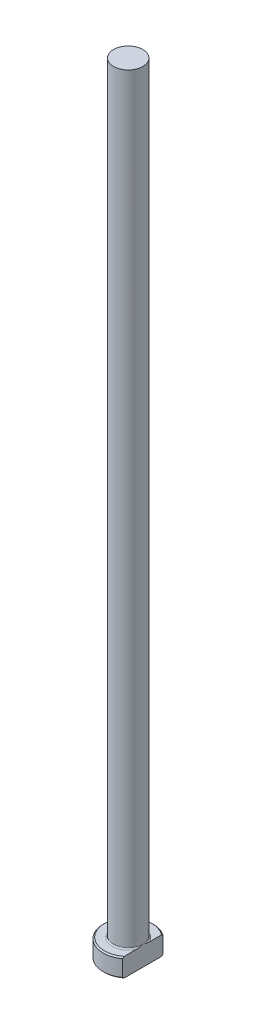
ISO-10303-21;
HEADER;
FILE_DESCRIPTION(('STEP AP214'),'2;1');
FILE_NAME('part.step','',(''),(''),'','','');
FILE_SCHEMA(('AUTOMOTIVE_DESIGN { 1 0 10303 214 1 1 1 1 }'));
ENDSEC;
DATA;
#1=APPLICATION_CONTEXT('core data for automotive mechanical design processes');
#2=APPLICATION_PROTOCOL_DEFINITION('international standard','automotive_design',2000,#1);
#3=PRODUCT_CONTEXT('',#1,'mechanical');
#4=PRODUCT('Part','Part','',(#3));
#5=PRODUCT_RELATED_PRODUCT_CATEGORY('part','',(#4));
#6=PRODUCT_DEFINITION_FORMATION('','',#4);
#7=PRODUCT_DEFINITION_CONTEXT('part definition',#1,'design');
#8=PRODUCT_DEFINITION('design','',#6,#7);
#9=PRODUCT_DEFINITION_SHAPE('','',#8);
#10=(LENGTH_UNIT() NAMED_UNIT(*) SI_UNIT(.MILLI.,.METRE.));
#11=(NAMED_UNIT(*) PLANE_ANGLE_UNIT() SI_UNIT($,.RADIAN.));
#12=(NAMED_UNIT(*) SI_UNIT($,.STERADIAN.) SOLID_ANGLE_UNIT());
#13=UNCERTAINTY_MEASURE_WITH_UNIT(LENGTH_MEASURE(1.E-05),#10,'distance_accuracy_value','');
#14=(GEOMETRIC_REPRESENTATION_CONTEXT(3) GLOBAL_UNCERTAINTY_ASSIGNED_CONTEXT((#13)) GLOBAL_UNIT_ASSIGNED_CONTEXT((#10,
#11,#12)) REPRESENTATION_CONTEXT('',''));
#15=CARTESIAN_POINT('',(0.,0.,0.));
#16=DIRECTION('',(0.,0.,1.));
#17=DIRECTION('',(1.,0.,0.));
#18=AXIS2_PLACEMENT_3D('',#15,#16,#17);
#19=CARTESIAN_POINT('',(0.,0.,0.));
#20=DIRECTION('',(0.,-1.,0.));
#21=DIRECTION('',(0.,0.,-1.));
#22=AXIS2_PLACEMENT_3D('',#19,#20,#21);
#23=PLANE('',#22);
#24=CARTESIAN_POINT('',(0.,0.,0.));
#25=DIRECTION('',(0.,-1.,0.));
#26=DIRECTION('',(0.,0.,-1.));
#27=AXIS2_PLACEMENT_3D('',#24,#25,#26);
#28=CIRCLE('',#27,3.79999999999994);
#29=CARTESIAN_POINT('',(2.34999999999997,0.,2.98621834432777));
#30=VERTEX_POINT('',#29);
#31=CARTESIAN_POINT('',(2.34999999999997,0.,-2.98621834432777));
#32=VERTEX_POINT('',#31);
#33=EDGE_CURVE('E98',#30,#32,#28,.T.);
#34=ORIENTED_EDGE('',*,*,#33,.T.);
#35=DIRECTION('',(0.,0.,1.));
#36=VECTOR('',#35,1.);
#37=CARTESIAN_POINT('',(2.34999999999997,0.,-3.23689666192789));
#38=LINE('',#37,#36);
#39=EDGE_CURVE('E83',#32,#30,#38,.T.);
#40=ORIENTED_EDGE('',*,*,#39,.T.);
#41=EDGE_LOOP('',(#34,#40));
#42=FACE_BOUND('',#41,.T.);
#43=ADVANCED_FACE('F32',(#42),#23,.T.);
#44=CARTESIAN_POINT('',(0.,259.958771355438,0.));
#45=DIRECTION('',(0.,1.,0.));
#46=DIRECTION('',(0.,0.,1.));
#47=AXIS2_PLACEMENT_3D('',#44,#45,#46);
#48=CYLINDRICAL_SURFACE('',#47,3.99999999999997);
#49=CARTESIAN_POINT('',(0.,2.79999999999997,0.));
#50=DIRECTION('',(0.,1.,0.));
#51=DIRECTION('',(0.,0.,1.));
#52=AXIS2_PLACEMENT_3D('',#49,#50,#51);
#53=CIRCLE('',#52,3.99999999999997);
#54=CARTESIAN_POINT('',(2.34999999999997,2.79999999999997,3.23689666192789));
#55=VERTEX_POINT('',#54);
#56=CARTESIAN_POINT('',(2.34999999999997,2.79999999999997,-3.23689666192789));
#57=VERTEX_POINT('',#56);
#58=EDGE_CURVE('E104',#55,#57,#53,.F.);
#59=ORIENTED_EDGE('',*,*,#58,.T.);
#60=DIRECTION('',(0.,-1.,0.));
#61=VECTOR('',#60,1.);
#62=CARTESIAN_POINT('',(2.34999999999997,125.,-3.23689666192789));
#63=LINE('',#62,#61);
#64=CARTESIAN_POINT('',(2.34999999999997,0.200000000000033,-3.23689666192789));
#65=VERTEX_POINT('',#64);
#66=EDGE_CURVE('E183',#57,#65,#63,.T.);
#67=ORIENTED_EDGE('',*,*,#66,.T.);
#68=CARTESIAN_POINT('',(0.,0.200000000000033,0.));
#69=DIRECTION('',(0.,-1.,0.));
#70=DIRECTION('',(0.,0.,-1.));
#71=AXIS2_PLACEMENT_3D('',#68,#69,#70);
#72=CIRCLE('',#71,3.99999999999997);
#73=CARTESIAN_POINT('',(2.34999999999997,0.200000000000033,3.23689666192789));
#74=VERTEX_POINT('',#73);
#75=EDGE_CURVE('E100',#65,#74,#72,.F.);
#76=ORIENTED_EDGE('',*,*,#75,.T.);
#77=DIRECTION('',(0.,-1.,0.));
#78=VECTOR('',#77,1.);
#79=CARTESIAN_POINT('',(2.34999999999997,125.,3.23689666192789));
#80=LINE('',#79,#78);
#81=EDGE_CURVE('E93',#55,#74,#80,.T.);
#82=ORIENTED_EDGE('',*,*,#81,.F.);
#83=EDGE_LOOP('',(#59,#67,#76,#82));
#84=FACE_BOUND('',#83,.T.);
#85=ADVANCED_FACE('F158',(#84),#48,.T.);
#86=CARTESIAN_POINT('',(-3.99999999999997,3.,0.));
#87=DIRECTION('',(0.,1.,0.));
#88=DIRECTION('',(0.,0.,1.));
#89=AXIS2_PLACEMENT_3D('',#86,#87,#88);
#90=PLANE('',#89);
#91=CARTESIAN_POINT('',(0.,3.,0.));
#92=DIRECTION('',(0.,1.,0.));
#93=DIRECTION('',(0.,0.,1.));
#94=AXIS2_PLACEMENT_3D('',#91,#92,#93);
#95=CIRCLE('',#94,3.79999999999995);
#96=CARTESIAN_POINT('',(2.34999999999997,3.,-2.98621834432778));
#97=VERTEX_POINT('',#96);
#98=CARTESIAN_POINT('',(2.34999999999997,3.,2.98621834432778));
#99=VERTEX_POINT('',#98);
#100=EDGE_CURVE('E178',#97,#99,#95,.T.);
#101=ORIENTED_EDGE('',*,*,#100,.T.);
#102=DIRECTION('',(0.,0.,-1.));
#103=VECTOR('',#102,1.);
#104=CARTESIAN_POINT('',(2.34999999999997,3.,0.));
#105=LINE('',#104,#103);
#106=CARTESIAN_POINT('',(2.34999999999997,2.99999999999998,0.989949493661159));
#107=VERTEX_POINT('',#106);
#108=EDGE_CURVE('E57',#99,#107,#105,.T.);
#109=ORIENTED_EDGE('',*,*,#108,.T.);
#110=CARTESIAN_POINT('',(0.,3.,0.));
#111=DIRECTION('',(0.,1.,0.));
#112=DIRECTION('',(0.,0.,1.));
#113=AXIS2_PLACEMENT_3D('',#110,#111,#112);
#114=CIRCLE('',#113,2.54999999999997);
#115=CARTESIAN_POINT('',(2.34999999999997,2.99999999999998,-0.989949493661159));
#116=VERTEX_POINT('',#115);
#117=EDGE_CURVE('E107',#107,#116,#114,.F.);
#118=ORIENTED_EDGE('',*,*,#117,.T.);
#119=EDGE_CURVE('E136',#116,#97,#105,.T.);
#120=ORIENTED_EDGE('',*,*,#119,.T.);
#121=EDGE_LOOP('',(#101,#109,#118,#120));
#122=FACE_BOUND('',#121,.T.);
#123=ADVANCED_FACE('F147',(#122),#90,.T.);
#124=CARTESIAN_POINT('',(0.,3.,0.));
#125=DIRECTION('',(0.,-1.,0.));
#126=DIRECTION('',(0.,0.,-1.));
#127=AXIS2_PLACEMENT_3D('',#124,#125,#126);
#128=CONICAL_SURFACE('',#127,3.79999999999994,0.785398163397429);
#129=ORIENTED_EDGE('',*,*,#58,.F.);
#130=CARTESIAN_POINT('',(2.34999999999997,-0.700856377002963,7.12322584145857));
#131=CARTESIAN_POINT('',(2.34999999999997,-0.585941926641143,7.00221702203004));
#132=CARTESIAN_POINT('',(2.34999999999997,-0.471176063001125,6.88106709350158));
#133=CARTESIAN_POINT('',(2.34999999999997,-0.241996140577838,6.63843358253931));
#134=CARTESIAN_POINT('',(2.34999999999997,-0.127582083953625,6.51694999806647));
#135=CARTESIAN_POINT('',(2.34999999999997,0.215169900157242,6.15179430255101));
#136=CARTESIAN_POINT('',(2.34999999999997,0.442895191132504,5.90754596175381));
#137=CARTESIAN_POINT('',(2.34999999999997,0.899497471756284,5.41318459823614));
#138=CARTESIAN_POINT('',(2.34999999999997,1.12833917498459,5.16303891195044));
#139=CARTESIAN_POINT('',(2.34999999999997,1.58241172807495,4.65967689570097));
#140=CARTESIAN_POINT('',(2.34999999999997,1.80764410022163,4.40646194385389));
#141=CARTESIAN_POINT('',(2.34999999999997,2.21600221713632,3.93721563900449));
#142=CARTESIAN_POINT('',(2.34999999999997,2.39996239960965,3.72191569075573));
#143=CARTESIAN_POINT('',(2.34999999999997,2.67143803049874,3.39502060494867));
#144=CARTESIAN_POINT('',(2.34999999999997,2.76124091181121,3.28532776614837));
#145=CARTESIAN_POINT('',(2.34999999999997,2.93886030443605,3.06434945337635));
#146=CARTESIAN_POINT('',(2.34999999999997,3.02667691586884,2.95306406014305));
#147=CARTESIAN_POINT('',(2.34999999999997,3.19949645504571,2.72877711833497));
#148=CARTESIAN_POINT('',(2.34999999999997,3.28450603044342,2.61578071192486));
#149=CARTESIAN_POINT('',(2.34999999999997,3.45108912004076,2.38722377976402));
#150=CARTESIAN_POINT('',(2.34999999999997,3.53266178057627,2.27166262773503));
#151=CARTESIAN_POINT('',(2.34999999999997,3.69088588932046,2.03753037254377));
#152=CARTESIAN_POINT('',(2.34999999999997,3.76754679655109,1.91896570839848));
#153=CARTESIAN_POINT('',(2.34999999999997,3.914131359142,1.67777357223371));
#154=CARTESIAN_POINT('',(2.34999999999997,3.98405924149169,1.55514871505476));
#155=CARTESIAN_POINT('',(2.34999999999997,4.09761312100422,1.33668409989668));
#156=CARTESIAN_POINT('',(2.34999999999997,4.14340149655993,1.24197842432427));
#157=CARTESIAN_POINT('',(2.34999999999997,4.22781425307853,1.04934973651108));
#158=CARTESIAN_POINT('',(2.34999999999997,4.26643728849,0.951426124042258));
#159=CARTESIAN_POINT('',(2.34999999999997,4.33394568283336,0.753323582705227));
#160=CARTESIAN_POINT('',(2.34999999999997,4.36292600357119,0.653177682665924));
#161=CARTESIAN_POINT('',(2.34999999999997,4.40928787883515,0.450234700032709));
#162=CARTESIAN_POINT('',(2.34999999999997,4.42667991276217,0.347440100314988));
#163=CARTESIAN_POINT('',(2.34999999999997,4.44509392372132,0.169206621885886));
#164=CARTESIAN_POINT('',(2.34999999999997,4.44931933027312,0.0940925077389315));
#165=CARTESIAN_POINT('',(2.34999999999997,4.45052785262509,-0.0561912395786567));
#166=CARTESIAN_POINT('',(2.34999999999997,4.4475119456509,-0.131360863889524));
#167=CARTESIAN_POINT('',(2.34999999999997,4.43440638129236,-0.281306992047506));
#168=CARTESIAN_POINT('',(2.34999999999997,4.42429455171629,-0.35608152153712));
#169=CARTESIAN_POINT('',(2.34999999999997,4.39757556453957,-0.504456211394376));
#170=CARTESIAN_POINT('',(2.34999999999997,4.3809668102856,-0.578056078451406));
#171=CARTESIAN_POINT('',(2.34999999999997,4.33328847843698,-0.756675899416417));
#172=CARTESIAN_POINT('',(2.34999999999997,4.29907594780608,-0.860854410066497));
#173=CARTESIAN_POINT('',(2.34999999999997,4.22140056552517,-1.06568624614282));
#174=CARTESIAN_POINT('',(2.34999999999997,4.17793098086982,-1.16633694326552));
#175=CARTESIAN_POINT('',(2.34999999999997,4.08383876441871,-1.36480952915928));
#176=CARTESIAN_POINT('',(2.34999999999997,4.03318169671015,-1.46261489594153));
#177=CARTESIAN_POINT('',(2.34999999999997,3.95330034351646,-1.60710986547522));
#178=CARTESIAN_POINT('',(2.34999999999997,3.92602819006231,-1.65489920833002));
#179=CARTESIAN_POINT('',(2.34999999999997,3.87034838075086,-1.74981001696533));
#180=CARTESIAN_POINT('',(2.34999999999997,3.84194077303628,-1.7969315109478));
#181=CARTESIAN_POINT('',(2.34999999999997,3.74736854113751,-1.95015020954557));
#182=CARTESIAN_POINT('',(2.34999999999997,3.67916021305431,-2.05498710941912));
#183=CARTESIAN_POINT('',(2.34999999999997,3.53901640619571,-2.26214963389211));
#184=CARTESIAN_POINT('',(2.34999999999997,3.4670800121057,-2.3644746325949));
#185=CARTESIAN_POINT('',(2.34999999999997,3.3203498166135,-2.56716934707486));
#186=CARTESIAN_POINT('',(2.34999999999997,3.24555383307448,-2.66753747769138));
#187=CARTESIAN_POINT('',(2.34999999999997,3.09379905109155,-2.86662881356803));
#188=CARTESIAN_POINT('',(2.34999999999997,3.01684010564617,-2.96535190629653));
#189=CARTESIAN_POINT('',(2.34999999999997,2.7830427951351,-3.26004190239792));
#190=CARTESIAN_POINT('',(2.34999999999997,2.6236754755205,-3.45399979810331));
#191=CARTESIAN_POINT('',(2.34999999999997,2.3007252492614,-3.83818937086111));
#192=CARTESIAN_POINT('',(2.34999999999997,2.13714428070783,-4.0284226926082));
#193=CARTESIAN_POINT('',(2.34999999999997,1.80677758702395,-4.40661405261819));
#194=CARTESIAN_POINT('',(2.34999999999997,1.63998718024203,-4.5945679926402));
#195=CARTESIAN_POINT('',(2.34999999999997,1.30429273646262,-4.968609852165));
#196=CARTESIAN_POINT('',(2.34999999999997,1.1353884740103,-5.15469756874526));
#197=CARTESIAN_POINT('',(2.34999999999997,0.79625864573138,-5.52521155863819));
#198=CARTESIAN_POINT('',(2.34999999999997,0.626035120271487,-5.70963970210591));
#199=CARTESIAN_POINT('',(2.34999999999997,0.284419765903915,-6.07741061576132));
#200=CARTESIAN_POINT('',(2.34999999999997,0.113027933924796,-6.26075338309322));
#201=CARTESIAN_POINT('',(2.34999999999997,-0.112202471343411,-6.50049374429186));
#202=CARTESIAN_POINT('',(2.34999999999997,-0.165631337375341,-6.5572768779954));
#203=CARTESIAN_POINT('',(2.34999999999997,-0.272578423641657,-6.67077412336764));
#204=CARTESIAN_POINT('',(2.34999999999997,-0.326096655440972,-6.72748822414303));
#205=CARTESIAN_POINT('',(2.34999999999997,-0.433118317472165,-6.84074875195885));
#206=CARTESIAN_POINT('',(2.34999999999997,-0.486621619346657,-6.89729530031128));
#207=CARTESIAN_POINT('',(2.34999999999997,-0.593691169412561,-7.0103135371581));
#208=CARTESIAN_POINT('',(2.34999999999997,-0.647257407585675,-7.0667852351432));
#209=CARTESIAN_POINT('',(2.34999999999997,-0.700856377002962,-7.12322584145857));
#210=B_SPLINE_CURVE_WITH_KNOTS('',3,(#130,#131,#132,#133,#134,#135,#136,#137,#138,#139,#140,
#141,#142,#143,#144,#145,#146,#147,#148,#149,#150,#151,#152,#153,#154,#155,#156,#157,#158,#159,
#160,#161,#162,#163,#164,#165,#166,#167,#168,#169,#170,#171,#172,#173,#174,#175,#176,#177,#178,
#179,#180,#181,#182,#183,#184,#185,#186,#187,#188,#189,#190,#191,#192,#193,#194,#195,#196,#197,
#198,#199,#200,#201,#202,#203,#204,#205,#206,#207,#208,#209),.UNSPECIFIED.,.F.,.F.,(4,2,2,2,2,2,
2,2,2,2,2,2,2,2,2,2,2,2,2,2,2,2,2,2,2,2,2,2,2,2,2,2,2,2,2,2,2,2,2,4),(0.,0.500635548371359,
1.00127416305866,2.00308434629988,3.02015300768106,4.03678077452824,4.88626044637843,
5.31153593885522,5.73678994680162,6.16095168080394,6.58521815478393,7.00864136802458,
7.43179699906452,7.74715928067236,8.06258072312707,8.37479699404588,8.68673054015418,
8.91210094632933,9.13744094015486,9.3634881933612,9.58959103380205,9.91793468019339,
10.246517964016,10.576732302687,10.7417913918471,10.9068434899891,11.2819382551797,
11.6571255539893,12.0326051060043,12.4081102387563,13.1610954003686,13.9137401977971,
14.6675815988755,15.4215040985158,16.1744305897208,16.9273590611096,17.1612622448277,
17.3951984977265,17.6287386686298,17.8622456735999),.UNSPECIFIED.);
#211=EDGE_CURVE('E135',#55,#99,#210,.T.);
#212=ORIENTED_EDGE('',*,*,#211,.T.);
#213=ORIENTED_EDGE('',*,*,#100,.F.);
#214=EDGE_CURVE('E127',#97,#57,#210,.T.);
#215=ORIENTED_EDGE('',*,*,#214,.T.);
#216=EDGE_LOOP('',(#129,#212,#213,#215));
#217=FACE_BOUND('',#216,.T.);
#218=ADVANCED_FACE('F143',(#217),#128,.T.);
#219=CARTESIAN_POINT('',(0.,0.200000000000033,0.));
#220=DIRECTION('',(0.,1.,0.));
#221=DIRECTION('',(0.,0.,1.));
#222=AXIS2_PLACEMENT_3D('',#219,#220,#221);
#223=CONICAL_SURFACE('',#222,3.99999999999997,0.785398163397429);
#224=ORIENTED_EDGE('',*,*,#75,.F.);
#225=CARTESIAN_POINT('',(2.34999999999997,3.70085637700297,-7.12322584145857));
#226=CARTESIAN_POINT('',(2.34999999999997,3.58594192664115,-7.00221702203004));
#227=CARTESIAN_POINT('',(2.34999999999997,3.47117606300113,-6.88106709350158));
#228=CARTESIAN_POINT('',(2.34999999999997,3.24199614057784,-6.63843358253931));
#229=CARTESIAN_POINT('',(2.34999999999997,3.12758208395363,-6.51694999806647));
#230=CARTESIAN_POINT('',(2.34999999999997,2.78483009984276,-6.15179430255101));
#231=CARTESIAN_POINT('',(2.34999999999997,2.5571048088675,-5.9075459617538));
#232=CARTESIAN_POINT('',(2.34999999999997,2.10050252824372,-5.41318459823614));
#233=CARTESIAN_POINT('',(2.34999999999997,1.87166082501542,-5.16303891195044));
#234=CARTESIAN_POINT('',(2.34999999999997,1.41758827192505,-4.65967689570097));
#235=CARTESIAN_POINT('',(2.34999999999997,1.19235589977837,-4.40646194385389));
#236=CARTESIAN_POINT('',(2.34999999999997,0.783997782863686,-3.93721563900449));
#237=CARTESIAN_POINT('',(2.34999999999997,0.600037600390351,-3.72191569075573));
#238=CARTESIAN_POINT('',(2.34999999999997,0.328561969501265,-3.39502060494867));
#239=CARTESIAN_POINT('',(2.34999999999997,0.238759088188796,-3.28532776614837));
#240=CARTESIAN_POINT('',(2.34999999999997,0.0611396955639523,-3.06434945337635));
#241=CARTESIAN_POINT('',(2.34999999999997,-0.0266769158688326,-2.95306406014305));
#242=CARTESIAN_POINT('',(2.34999999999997,-0.199496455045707,-2.72877711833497));
#243=CARTESIAN_POINT('',(2.34999999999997,-0.28450603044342,-2.61578071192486));
#244=CARTESIAN_POINT('',(2.34999999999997,-0.451089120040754,-2.38722377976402));
#245=CARTESIAN_POINT('',(2.34999999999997,-0.532661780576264,-2.27166262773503));
#246=CARTESIAN_POINT('',(2.34999999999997,-0.690885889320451,-2.03753037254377));
#247=CARTESIAN_POINT('',(2.34999999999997,-0.767546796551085,-1.91896570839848));
#248=CARTESIAN_POINT('',(2.34999999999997,-0.914131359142,-1.67777357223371));
#249=CARTESIAN_POINT('',(2.34999999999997,-0.984059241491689,-1.55514871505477));
#250=CARTESIAN_POINT('',(2.34999999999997,-1.09761312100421,-1.33668409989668));
#251=CARTESIAN_POINT('',(2.34999999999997,-1.14340149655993,-1.24197842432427));
#252=CARTESIAN_POINT('',(2.34999999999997,-1.22781425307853,-1.04934973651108));
#253=CARTESIAN_POINT('',(2.34999999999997,-1.26643728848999,-0.951426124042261));
#254=CARTESIAN_POINT('',(2.34999999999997,-1.33394568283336,-0.75332358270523));
#255=CARTESIAN_POINT('',(2.34999999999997,-1.36292600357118,-0.653177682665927));
#256=CARTESIAN_POINT('',(2.34999999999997,-1.40928787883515,-0.450234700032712));
#257=CARTESIAN_POINT('',(2.34999999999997,-1.42667991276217,-0.347440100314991));
#258=CARTESIAN_POINT('',(2.34999999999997,-1.44509392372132,-0.169206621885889));
#259=CARTESIAN_POINT('',(2.34999999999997,-1.44931933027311,-0.0940925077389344));
#260=CARTESIAN_POINT('',(2.34999999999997,-1.45052785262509,0.0561912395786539));
#261=CARTESIAN_POINT('',(2.34999999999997,-1.4475119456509,0.131360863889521));
#262=CARTESIAN_POINT('',(2.34999999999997,-1.43440638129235,0.281306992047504));
#263=CARTESIAN_POINT('',(2.34999999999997,-1.42429455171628,0.356081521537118));
#264=CARTESIAN_POINT('',(2.34999999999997,-1.39757556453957,0.504456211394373));
#265=CARTESIAN_POINT('',(2.34999999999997,-1.38096681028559,0.578056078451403));
#266=CARTESIAN_POINT('',(2.34999999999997,-1.33328847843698,0.756675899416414));
#267=CARTESIAN_POINT('',(2.34999999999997,-1.29907594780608,0.860854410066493));
#268=CARTESIAN_POINT('',(2.34999999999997,-1.22140056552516,1.06568624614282));
#269=CARTESIAN_POINT('',(2.34999999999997,-1.17793098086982,1.16633694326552));
#270=CARTESIAN_POINT('',(2.34999999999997,-1.08383876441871,1.36480952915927));
#271=CARTESIAN_POINT('',(2.34999999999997,-1.03318169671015,1.46261489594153));
#272=CARTESIAN_POINT('',(2.34999999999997,-0.953300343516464,1.60710986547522));
#273=CARTESIAN_POINT('',(2.34999999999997,-0.926028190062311,1.65489920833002));
#274=CARTESIAN_POINT('',(2.34999999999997,-0.870348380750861,1.74981001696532));
#275=CARTESIAN_POINT('',(2.34999999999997,-0.841940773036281,1.79693151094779));
#276=CARTESIAN_POINT('',(2.34999999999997,-0.747368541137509,1.95015020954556));
#277=CARTESIAN_POINT('',(2.34999999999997,-0.679160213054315,2.05498710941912));
#278=CARTESIAN_POINT('',(2.34999999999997,-0.539016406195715,2.2621496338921));
#279=CARTESIAN_POINT('',(2.34999999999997,-0.467080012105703,2.36447463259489));
#280=CARTESIAN_POINT('',(2.34999999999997,-0.3203498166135,2.56716934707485));
#281=CARTESIAN_POINT('',(2.34999999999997,-0.245553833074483,2.66753747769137));
#282=CARTESIAN_POINT('',(2.34999999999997,-0.0937990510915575,2.86662881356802));
#283=CARTESIAN_POINT('',(2.34999999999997,-0.0168401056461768,2.96535190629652));
#284=CARTESIAN_POINT('',(2.34999999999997,0.216957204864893,3.26004190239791));
#285=CARTESIAN_POINT('',(2.34999999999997,0.376324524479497,3.4539997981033));
#286=CARTESIAN_POINT('',(2.34999999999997,0.699274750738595,3.83818937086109));
#287=CARTESIAN_POINT('',(2.34999999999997,0.862855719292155,4.02842269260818));
#288=CARTESIAN_POINT('',(2.34999999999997,1.19322241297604,4.40661405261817));
#289=CARTESIAN_POINT('',(2.34999999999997,1.36001281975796,4.59456799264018));
#290=CARTESIAN_POINT('',(2.34999999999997,1.69570726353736,4.96860985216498));
#291=CARTESIAN_POINT('',(2.34999999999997,1.86461152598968,5.15469756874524));
#292=CARTESIAN_POINT('',(2.34999999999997,2.2037413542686,5.52521155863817));
#293=CARTESIAN_POINT('',(2.34999999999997,2.37396487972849,5.70963970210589));
#294=CARTESIAN_POINT('',(2.34999999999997,2.71558023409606,6.07741061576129));
#295=CARTESIAN_POINT('',(2.34999999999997,2.88697206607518,6.26075338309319));
#296=CARTESIAN_POINT('',(2.34999999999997,3.11220247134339,6.50049374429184));
#297=CARTESIAN_POINT('',(2.34999999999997,3.16563133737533,6.55727687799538));
#298=CARTESIAN_POINT('',(2.34999999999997,3.27257842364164,6.67077412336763));
#299=CARTESIAN_POINT('',(2.34999999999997,3.32609665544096,6.72748822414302));
#300=CARTESIAN_POINT('',(2.34999999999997,3.43311831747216,6.84074875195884));
#301=CARTESIAN_POINT('',(2.34999999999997,3.48662161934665,6.89729530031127));
#302=CARTESIAN_POINT('',(2.34999999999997,3.59369116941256,7.0103135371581));
#303=CARTESIAN_POINT('',(2.34999999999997,3.64725740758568,7.0667852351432));
#304=CARTESIAN_POINT('',(2.34999999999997,3.70085637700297,7.12322584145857));
#305=B_SPLINE_CURVE_WITH_KNOTS('',3,(#225,#226,#227,#228,#229,#230,#231,#232,#233,#234,#235,
#236,#237,#238,#239,#240,#241,#242,#243,#244,#245,#246,#247,#248,#249,#250,#251,#252,#253,#254,
#255,#256,#257,#258,#259,#260,#261,#262,#263,#264,#265,#266,#267,#268,#269,#270,#271,#272,#273,
#274,#275,#276,#277,#278,#279,#280,#281,#282,#283,#284,#285,#286,#287,#288,#289,#290,#291,#292,
#293,#294,#295,#296,#297,#298,#299,#300,#301,#302,#303,#304),.UNSPECIFIED.,.F.,.F.,(4,2,2,2,2,2,
2,2,2,2,2,2,2,2,2,2,2,2,2,2,2,2,2,2,2,2,2,2,2,2,2,2,2,2,2,2,2,2,2,4),(0.,0.50063554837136,
1.00127416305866,2.00308434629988,3.02015300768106,4.03678077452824,4.88626044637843,
5.31153593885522,5.73678994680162,6.16095168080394,6.58521815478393,7.00864136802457,
7.43179699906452,7.74715928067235,8.06258072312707,8.37479699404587,8.68673054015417,
8.91210094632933,9.13744094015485,9.3634881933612,9.58959103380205,9.91793468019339,
10.246517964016,10.576732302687,10.7417913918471,10.9068434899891,11.2819382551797,
11.6571255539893,12.0326051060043,12.4081102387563,13.1610954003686,13.913740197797,
14.6675815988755,15.4215040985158,16.1744305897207,16.9273590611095,17.1612622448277,
17.3951984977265,17.6287386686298,17.8622456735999),.UNSPECIFIED.);
#306=EDGE_CURVE('E86',#65,#32,#305,.T.);
#307=ORIENTED_EDGE('',*,*,#306,.T.);
#308=ORIENTED_EDGE('',*,*,#33,.F.);
#309=EDGE_CURVE('E89',#30,#74,#305,.T.);
#310=ORIENTED_EDGE('',*,*,#309,.T.);
#311=EDGE_LOOP('',(#224,#307,#308,#310));
#312=FACE_BOUND('',#311,.T.);
#313=ADVANCED_FACE('F97',(#312),#223,.T.);
#314=CARTESIAN_POINT('',(0.,3.19999999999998,0.));
#315=DIRECTION('',(0.,1.,0.));
#316=DIRECTION('',(0.,0.,1.));
#317=AXIS2_PLACEMENT_3D('',#314,#315,#316);
#318=TOROIDAL_SURFACE('',#317,2.54999999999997,0.2);
#319=CARTESIAN_POINT('',(2.34999999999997,3.19999999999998,0.));
#320=CARTESIAN_POINT('',(2.34999999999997,3.20000050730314,3.97301146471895E-11));
#321=CARTESIAN_POINT('',(2.34999999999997,3.20000101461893,-1.63653131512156E-07));
#322=CARTESIAN_POINT('',(2.34999999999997,3.20000197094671,-6.37225615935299E-07));
#323=CARTESIAN_POINT('',(2.34999999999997,3.20000241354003,-9.56393878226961E-07));
#324=CARTESIAN_POINT('',(2.34999999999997,3.20000331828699,-1.71856519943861E-06));
#325=CARTESIAN_POINT('',(2.34999999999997,3.20000377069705,-2.17342707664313E-06));
#326=CARTESIAN_POINT('',(2.34999999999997,3.20000459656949,-3.12835726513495E-06));
#327=CARTESIAN_POINT('',(2.34999999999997,3.20000497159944,-3.62715530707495E-06));
#328=CARTESIAN_POINT('',(2.34999999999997,3.20000632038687,-5.51226929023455E-06));
#329=CARTESIAN_POINT('',(2.34999999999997,3.20000721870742,-6.95455039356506E-06));
#330=CARTESIAN_POINT('',(2.34999999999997,3.20000873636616,-9.84867466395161E-06));
#331=CARTESIAN_POINT('',(2.34999999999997,3.20000937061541,-1.1293074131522E-05));
#332=CARTESIAN_POINT('',(2.34999999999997,3.20001195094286,-1.72675053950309E-05));
#333=CARTESIAN_POINT('',(2.34999999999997,3.20001382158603,-2.18342580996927E-05));
#334=CARTESIAN_POINT('',(2.34999999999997,3.2000166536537,-3.05622351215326E-05));
#335=CARTESIAN_POINT('',(2.34999999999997,3.2000177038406,-3.46947501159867E-05));
#336=CARTESIAN_POINT('',(2.34999999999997,3.20002522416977,-6.49852707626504E-05));
#337=CARTESIAN_POINT('',(2.34999999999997,3.20003079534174,-9.13194244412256E-05));
#338=CARTESIAN_POINT('',(2.34999999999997,3.2000551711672,-0.000194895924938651));
#339=CARTESIAN_POINT('',(2.34999999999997,3.20007855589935,-0.000271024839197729));
#340=CARTESIAN_POINT('',(2.34999999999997,3.20016914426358,-0.000571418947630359));
#341=CARTESIAN_POINT('',(2.34999999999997,3.20023327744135,-0.000796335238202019));
#342=CARTESIAN_POINT('',(2.34999999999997,3.20048915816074,-0.00168650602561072));
#343=CARTESIAN_POINT('',(2.34999999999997,3.20068469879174,-0.00235093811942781));
#344=CARTESIAN_POINT('',(2.34999999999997,3.20149494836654,-0.00511204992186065));
#345=CARTESIAN_POINT('',(2.34999999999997,3.20210492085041,-0.00720975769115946));
#346=CARTESIAN_POINT('',(2.34999999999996,3.2078795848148,-0.0270590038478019));
#347=CARTESIAN_POINT('',(2.34999999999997,3.21306460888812,-0.0448062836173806));
#348=CARTESIAN_POINT('',(2.34999999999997,3.22319239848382,-0.0796159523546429));
#349=CARTESIAN_POINT('',(2.34999999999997,3.22813669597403,-0.0966779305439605));
#350=CARTESIAN_POINT('',(2.34999999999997,3.23859474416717,-0.132940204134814));
#351=CARTESIAN_POINT('',(2.34999999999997,3.24410273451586,-0.152142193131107));
#352=CARTESIAN_POINT('',(2.34999999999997,3.25508732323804,-0.190778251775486));
#353=CARTESIAN_POINT('',(2.34999999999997,3.26056294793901,-0.210212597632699));
#354=CARTESIAN_POINT('',(2.34999999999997,3.27370944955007,-0.257444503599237));
#355=CARTESIAN_POINT('',(2.34999999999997,3.28131640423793,-0.285259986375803));
#356=CARTESIAN_POINT('',(2.34999999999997,3.29598901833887,-0.340268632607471));
#357=CARTESIAN_POINT('',(2.34999999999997,3.30306356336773,-0.367459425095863));
#358=CARTESIAN_POINT('',(2.34999999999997,3.32130563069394,-0.439911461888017));
#359=CARTESIAN_POINT('',(2.34999999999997,3.33209700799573,-0.485269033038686));
#360=CARTESIAN_POINT('',(2.34999999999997,3.35207859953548,-0.576761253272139));
#361=CARTESIAN_POINT('',(2.34999999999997,3.36125388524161,-0.622899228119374));
#362=CARTESIAN_POINT('',(2.34999999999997,3.37792670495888,-0.719572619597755));
#363=CARTESIAN_POINT('',(2.34999999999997,3.3852125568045,-0.770145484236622));
#364=CARTESIAN_POINT('',(2.34999999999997,3.39588167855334,-0.87157933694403));
#365=CARTESIAN_POINT('',(2.34999999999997,3.39927813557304,-0.92243876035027));
#366=CARTESIAN_POINT('',(2.34999999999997,3.4002008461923,-0.998268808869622));
#367=CARTESIAN_POINT('',(2.34999999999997,3.39983763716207,-1.02321254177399));
#368=CARTESIAN_POINT('',(2.34999999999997,3.39747624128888,-1.07301750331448));
#369=CARTESIAN_POINT('',(2.34999999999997,3.3954790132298,-1.09787877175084));
#370=CARTESIAN_POINT('',(2.34999999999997,3.38951136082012,-1.14688451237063));
#371=CARTESIAN_POINT('',(2.34999999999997,3.38557982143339,-1.17103355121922));
#372=CARTESIAN_POINT('',(2.34999999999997,3.37522613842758,-1.21877292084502));
#373=CARTESIAN_POINT('',(2.34999999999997,3.36880975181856,-1.24236441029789));
#374=CARTESIAN_POINT('',(2.34999999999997,3.3551050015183,-1.28139211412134));
#375=CARTESIAN_POINT('',(2.34999999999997,3.34867539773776,-1.29712639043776));
#376=CARTESIAN_POINT('',(2.34999999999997,3.33376103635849,-1.32763329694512));
#377=CARTESIAN_POINT('',(2.34999999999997,3.32527759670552,-1.34240653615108));
#378=CARTESIAN_POINT('',(2.34999999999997,3.30996401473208,-1.36406737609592));
#379=CARTESIAN_POINT('',(2.34999999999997,3.30402750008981,-1.37158321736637));
#380=CARTESIAN_POINT('',(2.34999999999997,3.29119867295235,-1.38575961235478));
#381=CARTESIAN_POINT('',(2.34999999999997,3.28430748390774,-1.39242115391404));
#382=CARTESIAN_POINT('',(2.34999999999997,3.27111764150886,-1.40316348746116));
#383=CARTESIAN_POINT('',(2.34999999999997,3.26502095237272,-1.40748979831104));
#384=CARTESIAN_POINT('',(2.34999999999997,3.25221216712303,-1.41511389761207));
#385=CARTESIAN_POINT('',(2.34999999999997,3.24550106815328,-1.41841331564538));
#386=CARTESIAN_POINT('',(2.34999999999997,3.23285600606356,-1.42321218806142));
#387=CARTESIAN_POINT('',(2.34999999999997,3.22700595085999,-1.42493102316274));
#388=CARTESIAN_POINT('',(2.34999999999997,3.21509932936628,-1.42735933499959));
#389=CARTESIAN_POINT('',(2.34999999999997,3.20904291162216,-1.42806952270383));
#390=CARTESIAN_POINT('',(2.34999999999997,3.19688696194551,-1.42841721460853));
#391=CARTESIAN_POINT('',(2.34999999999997,3.19078736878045,-1.42805261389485));
#392=CARTESIAN_POINT('',(2.34999999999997,3.17874187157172,-1.42628029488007));
#393=CARTESIAN_POINT('',(2.34999999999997,3.17279604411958,-1.42487206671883));
#394=CARTESIAN_POINT('',(2.34999999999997,3.16130302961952,-1.42116093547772));
#395=CARTESIAN_POINT('',(2.34999999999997,3.15575093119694,-1.41887295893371));
#396=CARTESIAN_POINT('',(2.34999999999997,3.1450217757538,-1.41355066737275));
#397=CARTESIAN_POINT('',(2.34999999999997,3.13984483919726,-1.41051611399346));
#398=CARTESIAN_POINT('',(2.34999999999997,3.12662898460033,-1.40165617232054));
#399=CARTESIAN_POINT('',(2.34999999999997,3.11894184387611,-1.39530630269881));
#400=CARTESIAN_POINT('',(2.34999999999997,3.10463862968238,-1.38149172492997));
#401=CARTESIAN_POINT('',(2.34999999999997,3.098026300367,-1.3740232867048));
#402=CARTESIAN_POINT('',(2.34999999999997,3.08144643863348,-1.35283380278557));
#403=CARTESIAN_POINT('',(2.34999999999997,3.07238753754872,-1.33840776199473));
#404=CARTESIAN_POINT('',(2.34999999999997,3.05644883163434,-1.30845169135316));
#405=CARTESIAN_POINT('',(2.34999999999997,3.04957029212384,-1.29292102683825));
#406=CARTESIAN_POINT('',(2.34999999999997,3.03757508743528,-1.26136930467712));
#407=CARTESIAN_POINT('',(2.34999999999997,3.03244275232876,-1.24535409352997));
#408=CARTESIAN_POINT('',(2.34999999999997,3.02353297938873,-1.21294404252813));
#409=CARTESIAN_POINT('',(2.34999999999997,3.01975697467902,-1.19654882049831));
#410=CARTESIAN_POINT('',(2.34999999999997,3.01003121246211,-1.14664956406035));
#411=CARTESIAN_POINT('',(2.34999999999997,3.00581272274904,-1.11281111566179));
#412=CARTESIAN_POINT('',(2.34999999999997,2.9993669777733,-1.02798337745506));
#413=CARTESIAN_POINT('',(2.34999999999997,2.99918477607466,-0.976864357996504));
#414=CARTESIAN_POINT('',(2.34999999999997,3.00375848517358,-0.874705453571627));
#415=CARTESIAN_POINT('',(2.34999999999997,3.00853512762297,-0.823666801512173));
#416=CARTESIAN_POINT('',(2.34999999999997,3.02118536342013,-0.725382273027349));
#417=CARTESIAN_POINT('',(2.34999999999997,3.02883644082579,-0.678106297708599));
#418=CARTESIAN_POINT('',(2.34999999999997,3.04631118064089,-0.584387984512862));
#419=CARTESIAN_POINT('',(2.34999999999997,3.05611566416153,-0.537941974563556));
#420=CARTESIAN_POINT('',(2.34999999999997,3.07458329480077,-0.457342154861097));
#421=CARTESIAN_POINT('',(2.34999999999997,3.08288953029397,-0.423104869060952));
#422=CARTESIAN_POINT('',(2.34999999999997,3.100392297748,-0.353909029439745));
#423=CARTESIAN_POINT('',(2.34999999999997,3.10960639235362,-0.318954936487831));
#424=CARTESIAN_POINT('',(2.34999999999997,3.12565453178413,-0.259778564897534));
#425=CARTESIAN_POINT('',(2.34999999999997,3.13236140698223,-0.235521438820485));
#426=CARTESIAN_POINT('',(2.34999999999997,3.14587896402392,-0.187317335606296));
#427=CARTESIAN_POINT('',(2.34999999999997,3.15268775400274,-0.16336982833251));
#428=CARTESIAN_POINT('',(2.34999999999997,3.16564916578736,-0.118168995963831));
#429=CARTESIAN_POINT('',(2.34999999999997,3.17179049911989,-0.0969123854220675));
#430=CARTESIAN_POINT('',(2.34999999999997,3.18438963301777,-0.0535409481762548));
#431=CARTESIAN_POINT('',(2.34999999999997,3.19085004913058,-0.0314268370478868));
#432=CARTESIAN_POINT('',(2.34999999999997,3.19789544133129,-0.00720839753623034));
#433=CARTESIAN_POINT('',(2.34999999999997,3.1985058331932,-0.00510934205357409));
#434=CARTESIAN_POINT('',(2.34999999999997,3.19931618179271,-0.00234791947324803));
#435=CARTESIAN_POINT('',(2.34999999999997,3.19951141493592,-0.00168452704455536));
#436=CARTESIAN_POINT('',(2.34999999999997,3.1997669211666,-0.000795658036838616));
#437=CARTESIAN_POINT('',(2.34999999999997,3.19983097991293,-0.000571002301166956));
#438=CARTESIAN_POINT('',(2.34999999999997,3.19992147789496,-0.000270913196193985));
#439=CARTESIAN_POINT('',(2.34999999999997,3.19994484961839,-0.000194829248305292));
#440=CARTESIAN_POINT('',(2.34999999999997,3.19996921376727,-9.13049088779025E-05));
#441=CARTESIAN_POINT('',(2.34999999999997,3.19997478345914,-6.49772799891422E-05));
#442=CARTESIAN_POINT('',(2.34999999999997,3.19998230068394,-3.46933684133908E-05));
#443=CARTESIAN_POINT('',(2.34999999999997,3.19998335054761,-3.05612366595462E-05));
#444=CARTESIAN_POINT('',(2.34999999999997,3.19998618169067,-2.1834026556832E-05));
#445=CARTESIAN_POINT('',(2.34999999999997,3.19998805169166,-1.7267637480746E-05));
#446=CARTESIAN_POINT('',(2.34999999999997,3.19999063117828,-1.12935765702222E-05));
#447=CARTESIAN_POINT('',(2.34999999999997,3.19999126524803,-9.84920577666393E-06));
#448=CARTESIAN_POINT('',(2.34999999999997,3.19999278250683,-6.95510752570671E-06));
#449=CARTESIAN_POINT('',(2.34999999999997,3.19999368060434,-5.51282056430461E-06));
#450=CARTESIAN_POINT('',(2.34999999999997,3.1999950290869,-3.62766169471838E-06));
#451=CARTESIAN_POINT('',(2.34999999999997,3.19999540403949,-3.12884229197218E-06));
#452=CARTESIAN_POINT('',(2.34999999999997,3.19999622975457,-2.17385542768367E-06));
#453=CARTESIAN_POINT('',(2.34999999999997,3.19999668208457,-1.7189578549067E-06));
#454=CARTESIAN_POINT('',(2.34999999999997,3.19999758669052,-9.56701781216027E-07));
#455=CARTESIAN_POINT('',(2.34999999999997,3.19999802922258,-6.37487274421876E-07));
#456=CARTESIAN_POINT('',(2.34999999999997,3.19999898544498,-1.63799560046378E-07));
#457=CARTESIAN_POINT('',(2.34999999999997,3.19999949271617,-3.97285993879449E-11));
#458=CARTESIAN_POINT('',(2.34999999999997,3.19999999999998,0.));
#459=B_SPLINE_CURVE_WITH_KNOTS('',3,(#319,#320,#321,#322,#323,#324,#325,#326,#327,#328,#329,
#330,#331,#332,#333,#334,#335,#336,#337,#338,#339,#340,#341,#342,#343,#344,#345,#346,#347,#348,
#349,#350,#351,#352,#353,#354,#355,#356,#357,#358,#359,#360,#361,#362,#363,#364,#365,#366,#367,
#368,#369,#370,#371,#372,#373,#374,#375,#376,#377,#378,#379,#380,#381,#382,#383,#384,#385,#386,
#387,#388,#389,#390,#391,#392,#393,#394,#395,#396,#397,#398,#399,#400,#401,#402,#403,#404,#405,
#406,#407,#408,#409,#410,#411,#412,#413,#414,#415,#416,#417,#418,#419,#420,#421,#422,#423,#424,
#425,#426,#427,#428,#429,#430,#431,#432,#433,#434,#435,#436,#437,#438,#439,#440,#441,#442,#443,
#444,#445,#446,#447,#448,#449,#450,#451,#452,#453,#454,#455,#456,#457,#458),.UNSPECIFIED.,.T.,
.F.,(4,2,2,2,2,2,2,2,2,2,2,2,2,2,2,2,2,2,2,2,2,2,2,2,2,2,2,2,2,2,2,2,2,2,2,2,2,2,2,2,2,2,2,2,2,
2,2,2,2,2,2,2,2,2,2,2,2,2,2,2,2,2,2,2,2,2,2,2,2,4),(0.,1.52815232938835E-06,
3.16151347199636E-06,5.07598848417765E-06,6.9467232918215E-06,1.2023610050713E-05,
1.67522119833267E-05,3.15258107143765E-05,4.43009343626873E-05,0.000125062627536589,
0.000363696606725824,0.00106562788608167,0.00314310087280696,0.00969727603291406,
0.0651627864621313,0.118455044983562,0.178383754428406,0.238956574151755,0.325465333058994,
0.409751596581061,0.549599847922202,0.69067896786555,0.843870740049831,0.99654155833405,
1.07134060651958,1.14609579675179,1.21940608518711,1.29254753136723,1.3434432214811,
1.39430633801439,1.42297722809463,1.45161466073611,1.47396609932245,1.49628188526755,
1.51449565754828,1.5326965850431,1.55093318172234,1.56917869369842,1.58712740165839,
1.60508184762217,1.63482087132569,1.66466136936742,1.71547705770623,1.76632218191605,
1.81669819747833,1.86712728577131,1.96917546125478,2.12216244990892,2.27579162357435,
2.41939223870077,2.56176232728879,2.667446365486,2.77588510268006,2.85138624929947,
2.92607549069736,2.99245400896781,3.06156674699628,3.06812515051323,3.07019937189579,
3.07090048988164,3.07113898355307,3.07121972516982,3.07123249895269,3.07124727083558,
3.07125199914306,3.07125707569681,3.07125894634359,3.07126086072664,3.07126249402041,
3.07126402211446),.UNSPECIFIED.);
#460=CARTESIAN_POINT('',(2.34999999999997,3.19999999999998,0.));
#461=VERTEX_POINT('',#460);
#462=EDGE_CURVE('E11',#116,#461,#459,.T.);
#463=ORIENTED_EDGE('',*,*,#462,.F.);
#464=ORIENTED_EDGE('',*,*,#117,.F.);
#465=CARTESIAN_POINT('',(2.34999999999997,3.19999999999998,0.));
#466=CARTESIAN_POINT('',(2.34999999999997,3.19999949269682,-3.97300613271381E-11));
#467=CARTESIAN_POINT('',(2.34999999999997,3.19999898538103,1.63653131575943E-07));
#468=CARTESIAN_POINT('',(2.34999999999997,3.19999802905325,6.37225615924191E-07));
#469=CARTESIAN_POINT('',(2.34999999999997,3.19999758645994,9.56393878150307E-07));
#470=CARTESIAN_POINT('',(2.34999999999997,3.19999668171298,1.71856519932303E-06));
#471=CARTESIAN_POINT('',(2.34999999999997,3.19999622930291,2.17342707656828E-06));
#472=CARTESIAN_POINT('',(2.34999999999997,3.19999540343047,3.12835726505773E-06));
#473=CARTESIAN_POINT('',(2.34999999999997,3.19999502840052,3.62715530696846E-06));
#474=CARTESIAN_POINT('',(2.34999999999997,3.19999367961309,5.51226928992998E-06));
#475=CARTESIAN_POINT('',(2.34999999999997,3.19999278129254,6.95455039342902E-06));
#476=CARTESIAN_POINT('',(2.34999999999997,3.1999912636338,9.84867466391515E-06));
#477=CARTESIAN_POINT('',(2.34999999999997,3.19999062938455,1.12930741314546E-05));
#478=CARTESIAN_POINT('',(2.34999999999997,3.1999880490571,1.72675053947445E-05));
#479=CARTESIAN_POINT('',(2.34999999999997,3.19998617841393,2.18342580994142E-05));
#480=CARTESIAN_POINT('',(2.34999999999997,3.19998334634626,3.0562235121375E-05));
#481=CARTESIAN_POINT('',(2.34999999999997,3.19998229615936,3.46947501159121E-05));
#482=CARTESIAN_POINT('',(2.34999999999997,3.19997477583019,6.49852707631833E-05));
#483=CARTESIAN_POINT('',(2.34999999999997,3.19996920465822,9.13194244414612E-05));
#484=CARTESIAN_POINT('',(2.34999999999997,3.19994482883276,0.000194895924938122));
#485=CARTESIAN_POINT('',(2.34999999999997,3.19992144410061,0.000271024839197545));
#486=CARTESIAN_POINT('',(2.34999999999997,3.19983085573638,0.000571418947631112));
#487=CARTESIAN_POINT('',(2.34999999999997,3.19976672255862,0.000796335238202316));
#488=CARTESIAN_POINT('',(2.34999999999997,3.19951084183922,0.00168650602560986));
#489=CARTESIAN_POINT('',(2.34999999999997,3.19931530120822,0.00235093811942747));
#490=CARTESIAN_POINT('',(2.34999999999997,3.19850505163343,0.00511204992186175));
#491=CARTESIAN_POINT('',(2.34999999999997,3.19789507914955,0.00720975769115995));
#492=CARTESIAN_POINT('',(2.34999999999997,3.19212041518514,0.0270590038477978));
#493=CARTESIAN_POINT('',(2.34999999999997,3.18693539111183,0.0448062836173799));
#494=CARTESIAN_POINT('',(2.34999999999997,3.17680760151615,0.0796159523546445));
#495=CARTESIAN_POINT('',(2.34999999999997,3.17186330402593,0.0966779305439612));
#496=CARTESIAN_POINT('',(2.34999999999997,3.16140525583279,0.132940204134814));
#497=CARTESIAN_POINT('',(2.34999999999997,3.1558972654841,0.152142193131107));
#498=CARTESIAN_POINT('',(2.34999999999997,3.14491267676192,0.190778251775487));
#499=CARTESIAN_POINT('',(2.34999999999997,3.13943705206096,0.210212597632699));
#500=CARTESIAN_POINT('',(2.34999999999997,3.12629055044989,0.257444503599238));
#501=CARTESIAN_POINT('',(2.34999999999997,3.11868359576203,0.285259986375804));
#502=CARTESIAN_POINT('',(2.34999999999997,3.10401098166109,0.340268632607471));
#503=CARTESIAN_POINT('',(2.34999999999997,3.09693643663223,0.367459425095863));
#504=CARTESIAN_POINT('',(2.34999999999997,3.07869436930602,0.439911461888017));
#505=CARTESIAN_POINT('',(2.34999999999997,3.06790299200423,0.485269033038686));
#506=CARTESIAN_POINT('',(2.34999999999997,3.04792140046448,0.576761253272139));
#507=CARTESIAN_POINT('',(2.34999999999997,3.03874611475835,0.622899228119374));
#508=CARTESIAN_POINT('',(2.34999999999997,3.02207329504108,0.719572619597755));
#509=CARTESIAN_POINT('',(2.34999999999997,3.01478744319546,0.770145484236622));
#510=CARTESIAN_POINT('',(2.34999999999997,3.00411832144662,0.87157933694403));
#511=CARTESIAN_POINT('',(2.34999999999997,3.00072186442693,0.92243876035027));
#512=CARTESIAN_POINT('',(2.34999999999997,2.99979915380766,0.998268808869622));
#513=CARTESIAN_POINT('',(2.34999999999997,3.00016236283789,1.02321254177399));
#514=CARTESIAN_POINT('',(2.34999999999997,3.00252375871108,1.07301750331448));
#515=CARTESIAN_POINT('',(2.34999999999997,3.00452098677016,1.09787877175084));
#516=CARTESIAN_POINT('',(2.34999999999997,3.01048863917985,1.14688451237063));
#517=CARTESIAN_POINT('',(2.34999999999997,3.01442017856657,1.17103355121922));
#518=CARTESIAN_POINT('',(2.34999999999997,3.02477386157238,1.21877292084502));
#519=CARTESIAN_POINT('',(2.34999999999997,3.0311902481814,1.24236441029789));
#520=CARTESIAN_POINT('',(2.34999999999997,3.04489499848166,1.28139211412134));
#521=CARTESIAN_POINT('',(2.34999999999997,3.0513246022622,1.29712639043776));
#522=CARTESIAN_POINT('',(2.34999999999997,3.06623896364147,1.32763329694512));
#523=CARTESIAN_POINT('',(2.34999999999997,3.07472240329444,1.34240653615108));
#524=CARTESIAN_POINT('',(2.34999999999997,3.09003598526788,1.36406737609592));
#525=CARTESIAN_POINT('',(2.34999999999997,3.09597249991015,1.37158321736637));
#526=CARTESIAN_POINT('',(2.34999999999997,3.10880132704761,1.38575961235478));
#527=CARTESIAN_POINT('',(2.34999999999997,3.11569251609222,1.39242115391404));
#528=CARTESIAN_POINT('',(2.34999999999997,3.1288823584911,1.40316348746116));
#529=CARTESIAN_POINT('',(2.34999999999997,3.13497904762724,1.40748979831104));
#530=CARTESIAN_POINT('',(2.34999999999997,3.14778783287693,1.41511389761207));
#531=CARTESIAN_POINT('',(2.34999999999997,3.15449893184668,1.41841331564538));
#532=CARTESIAN_POINT('',(2.34999999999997,3.1671439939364,1.42321218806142));
#533=CARTESIAN_POINT('',(2.34999999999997,3.17299404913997,1.42493102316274));
#534=CARTESIAN_POINT('',(2.34999999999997,3.18490067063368,1.42735933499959));
#535=CARTESIAN_POINT('',(2.34999999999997,3.19095708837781,1.42806952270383));
#536=CARTESIAN_POINT('',(2.34999999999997,3.20311303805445,1.42841721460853));
#537=CARTESIAN_POINT('',(2.34999999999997,3.20921263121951,1.42805261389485));
#538=CARTESIAN_POINT('',(2.34999999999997,3.22125812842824,1.42628029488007));
#539=CARTESIAN_POINT('',(2.34999999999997,3.22720395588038,1.42487206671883));
#540=CARTESIAN_POINT('',(2.34999999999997,3.23869697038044,1.42116093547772));
#541=CARTESIAN_POINT('',(2.34999999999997,3.24424906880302,1.41887295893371));
#542=CARTESIAN_POINT('',(2.34999999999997,3.25497822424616,1.41355066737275));
#543=CARTESIAN_POINT('',(2.34999999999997,3.26015516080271,1.41051611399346));
#544=CARTESIAN_POINT('',(2.34999999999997,3.27337101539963,1.40165617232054));
#545=CARTESIAN_POINT('',(2.34999999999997,3.28105815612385,1.39530630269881));
#546=CARTESIAN_POINT('',(2.34999999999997,3.29536137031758,1.38149172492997));
#547=CARTESIAN_POINT('',(2.34999999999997,3.30197369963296,1.3740232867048));
#548=CARTESIAN_POINT('',(2.34999999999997,3.31855356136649,1.35283380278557));
#549=CARTESIAN_POINT('',(2.34999999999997,3.32761246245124,1.33840776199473));
#550=CARTESIAN_POINT('',(2.34999999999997,3.34355116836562,1.30845169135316));
#551=CARTESIAN_POINT('',(2.34999999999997,3.35042970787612,1.29292102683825));
#552=CARTESIAN_POINT('',(2.34999999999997,3.36242491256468,1.26136930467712));
#553=CARTESIAN_POINT('',(2.34999999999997,3.36755724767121,1.24535409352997));
#554=CARTESIAN_POINT('',(2.34999999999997,3.37646702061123,1.21294404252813));
#555=CARTESIAN_POINT('',(2.34999999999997,3.38024302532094,1.19654882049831));
#556=CARTESIAN_POINT('',(2.34999999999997,3.38996878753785,1.14664956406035));
#557=CARTESIAN_POINT('',(2.34999999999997,3.39418727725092,1.11281111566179));
#558=CARTESIAN_POINT('',(2.34999999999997,3.40063302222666,1.02798337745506));
#559=CARTESIAN_POINT('',(2.34999999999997,3.4008152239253,0.976864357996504));
#560=CARTESIAN_POINT('',(2.34999999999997,3.39624151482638,0.874705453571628));
#561=CARTESIAN_POINT('',(2.34999999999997,3.39146487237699,0.823666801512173));
#562=CARTESIAN_POINT('',(2.34999999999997,3.37881463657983,0.72538227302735));
#563=CARTESIAN_POINT('',(2.34999999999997,3.37116355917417,0.678106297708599));
#564=CARTESIAN_POINT('',(2.34999999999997,3.35368881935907,0.584387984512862));
#565=CARTESIAN_POINT('',(2.34999999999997,3.34388433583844,0.537941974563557));
#566=CARTESIAN_POINT('',(2.34999999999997,3.32541670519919,0.457342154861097));
#567=CARTESIAN_POINT('',(2.34999999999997,3.31711046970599,0.423104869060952));
#568=CARTESIAN_POINT('',(2.34999999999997,3.29960770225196,0.353909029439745));
#569=CARTESIAN_POINT('',(2.34999999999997,3.29039360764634,0.318954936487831));
#570=CARTESIAN_POINT('',(2.34999999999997,3.27434546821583,0.259778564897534));
#571=CARTESIAN_POINT('',(2.34999999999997,3.26763859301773,0.235521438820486));
#572=CARTESIAN_POINT('',(2.34999999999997,3.25412103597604,0.187317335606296));
#573=CARTESIAN_POINT('',(2.34999999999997,3.24731224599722,0.16336982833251));
#574=CARTESIAN_POINT('',(2.34999999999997,3.2343508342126,0.118168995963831));
#575=CARTESIAN_POINT('',(2.34999999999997,3.22820950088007,0.0969123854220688));
#576=CARTESIAN_POINT('',(2.34999999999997,3.21561036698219,0.053540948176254));
#577=CARTESIAN_POINT('',(2.34999999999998,3.20914995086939,0.0314268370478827));
#578=CARTESIAN_POINT('',(2.34999999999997,3.20210455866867,0.00720839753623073));
#579=CARTESIAN_POINT('',(2.34999999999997,3.20149416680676,0.00510934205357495));
#580=CARTESIAN_POINT('',(2.34999999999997,3.20068381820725,0.0023479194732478));
#581=CARTESIAN_POINT('',(2.34999999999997,3.20048858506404,0.00168452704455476));
#582=CARTESIAN_POINT('',(2.34999999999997,3.20023307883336,0.000795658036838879));
#583=CARTESIAN_POINT('',(2.34999999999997,3.20016902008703,0.000571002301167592));
#584=CARTESIAN_POINT('',(2.34999999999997,3.200078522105,0.000270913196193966));
#585=CARTESIAN_POINT('',(2.34999999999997,3.20005515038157,0.000194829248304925));
#586=CARTESIAN_POINT('',(2.34999999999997,3.20003078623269,9.13049088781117E-05));
#587=CARTESIAN_POINT('',(2.34999999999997,3.20002521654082,6.49772799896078E-05));
#588=CARTESIAN_POINT('',(2.34999999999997,3.20001769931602,3.46933684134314E-05));
#589=CARTESIAN_POINT('',(2.34999999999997,3.20001664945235,3.05612366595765E-05));
#590=CARTESIAN_POINT('',(2.34999999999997,3.20001381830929,2.18340265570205E-05));
#591=CARTESIAN_POINT('',(2.34999999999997,3.2000119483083,1.72676374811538E-05));
#592=CARTESIAN_POINT('',(2.34999999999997,3.20000936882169,1.1293576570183E-05));
#593=CARTESIAN_POINT('',(2.34999999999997,3.20000873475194,9.84920577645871E-06));
#594=CARTESIAN_POINT('',(2.34999999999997,3.20000721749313,6.95510752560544E-06));
#595=CARTESIAN_POINT('',(2.34999999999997,3.20000631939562,5.51282056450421E-06));
#596=CARTESIAN_POINT('',(2.34999999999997,3.20000497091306,3.62766169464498E-06));
#597=CARTESIAN_POINT('',(2.34999999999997,3.20000459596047,3.12884229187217E-06));
#598=CARTESIAN_POINT('',(2.34999999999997,3.20000377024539,2.17385542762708E-06));
#599=CARTESIAN_POINT('',(2.34999999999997,3.2000033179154,1.71895785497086E-06));
#600=CARTESIAN_POINT('',(2.34999999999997,3.20000241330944,9.56701781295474E-07));
#601=CARTESIAN_POINT('',(2.34999999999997,3.20000197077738,6.37487274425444E-07));
#602=CARTESIAN_POINT('',(2.34999999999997,3.20000101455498,1.63799559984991E-07));
#603=CARTESIAN_POINT('',(2.34999999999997,3.20000050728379,3.97285460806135E-11));
#604=CARTESIAN_POINT('',(2.34999999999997,3.19999999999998,0.));
#605=B_SPLINE_CURVE_WITH_KNOTS('',3,(#465,#466,#467,#468,#469,#470,#471,#472,#473,#474,#475,
#476,#477,#478,#479,#480,#481,#482,#483,#484,#485,#486,#487,#488,#489,#490,#491,#492,#493,#494,
#495,#496,#497,#498,#499,#500,#501,#502,#503,#504,#505,#506,#507,#508,#509,#510,#511,#512,#513,
#514,#515,#516,#517,#518,#519,#520,#521,#522,#523,#524,#525,#526,#527,#528,#529,#530,#531,#532,
#533,#534,#535,#536,#537,#538,#539,#540,#541,#542,#543,#544,#545,#546,#547,#548,#549,#550,#551,
#552,#553,#554,#555,#556,#557,#558,#559,#560,#561,#562,#563,#564,#565,#566,#567,#568,#569,#570,
#571,#572,#573,#574,#575,#576,#577,#578,#579,#580,#581,#582,#583,#584,#585,#586,#587,#588,#589,
#590,#591,#592,#593,#594,#595,#596,#597,#598,#599,#600,#601,#602,#603,#604),.UNSPECIFIED.,.T.,
.F.,(4,2,2,2,2,2,2,2,2,2,2,2,2,2,2,2,2,2,2,2,2,2,2,2,2,2,2,2,2,2,2,2,2,2,2,2,2,2,2,2,2,2,2,2,2,
2,2,2,2,2,2,2,2,2,2,2,2,2,2,2,2,2,2,2,2,2,2,2,2,4),(0.,1.52815232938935E-06,
3.16151347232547E-06,5.07598848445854E-06,6.94672329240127E-06,1.20236100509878E-05,
1.67522119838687E-05,3.1525810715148E-05,4.43009343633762E-05,0.000125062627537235,
0.000363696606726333,0.00106562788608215,0.00314310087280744,0.00969727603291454,
0.0651627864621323,0.118455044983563,0.178383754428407,0.238956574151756,0.325465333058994,
0.409751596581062,0.549599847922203,0.69067896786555,0.843870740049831,0.996541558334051,
1.07134060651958,1.14609579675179,1.21940608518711,1.29254753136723,1.3434432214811,
1.39430633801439,1.42297722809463,1.45161466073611,1.47396609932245,1.49628188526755,
1.51449565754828,1.5326965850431,1.55093318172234,1.56917869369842,1.58712740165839,
1.60508184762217,1.63482087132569,1.66466136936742,1.71547705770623,1.76632218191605,
1.81669819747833,1.86712728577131,1.96917546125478,2.12216244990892,2.27579162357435,
2.41939223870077,2.56176232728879,2.667446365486,2.77588510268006,2.85138624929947,
2.92607549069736,2.99245400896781,3.06156674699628,3.06812515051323,3.07019937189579,
3.07090048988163,3.07113898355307,3.07121972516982,3.07123249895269,3.07124727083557,
3.07125199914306,3.07125707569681,3.07125894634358,3.07126086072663,3.07126249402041,
3.07126402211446),.UNSPECIFIED.);
#606=EDGE_CURVE('E46',#461,#107,#605,.T.);
#607=ORIENTED_EDGE('',*,*,#606,.F.);
#608=CARTESIAN_POINT('',(0.,3.19999999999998,0.));
#609=DIRECTION('',(0.,1.,0.));
#610=DIRECTION('',(0.,0.,1.));
#611=AXIS2_PLACEMENT_3D('',#608,#609,#610);
#612=CIRCLE('',#611,2.34999999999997);
#613=EDGE_CURVE('E103',#461,#461,#612,.T.);
#614=ORIENTED_EDGE('',*,*,#613,.F.);
#615=EDGE_LOOP('',(#463,#464,#607,#614));
#616=FACE_BOUND('',#615,.T.);
#617=ADVANCED_FACE('F34',(#616),#318,.F.);
#618=CARTESIAN_POINT('',(0.,259.958771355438,0.));
#619=DIRECTION('',(0.,1.,0.));
#620=DIRECTION('',(0.,0.,1.));
#621=AXIS2_PLACEMENT_3D('',#618,#619,#620);
#622=CYLINDRICAL_SURFACE('',#621,2.34999999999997);
#623=ORIENTED_EDGE('',*,*,#613,.T.);
#624=EDGE_LOOP('',(#623));
#625=FACE_BOUND('',#624,.T.);
#626=CARTESIAN_POINT('',(0.,125.,0.));
#627=DIRECTION('',(0.,1.,0.));
#628=DIRECTION('',(0.,0.,1.));
#629=AXIS2_PLACEMENT_3D('',#626,#627,#628);
#630=CIRCLE('',#629,2.34999999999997);
#631=CARTESIAN_POINT('',(0.,125.,2.34999999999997));
#632=VERTEX_POINT('',#631);
#633=EDGE_CURVE('E101',#632,#632,#630,.T.);
#634=ORIENTED_EDGE('',*,*,#633,.F.);
#635=EDGE_LOOP('',(#634));
#636=FACE_BOUND('',#635,.T.);
#637=ADVANCED_FACE('F155',(#625,#636),#622,.T.);
#638=CARTESIAN_POINT('',(-2.34999999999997,125.,0.));
#639=DIRECTION('',(0.,1.,0.));
#640=DIRECTION('',(0.,0.,1.));
#641=AXIS2_PLACEMENT_3D('',#638,#639,#640);
#642=PLANE('',#641);
#643=ORIENTED_EDGE('',*,*,#633,.T.);
#644=EDGE_LOOP('',(#643));
#645=FACE_BOUND('',#644,.T.);
#646=ADVANCED_FACE('F121',(#645),#642,.T.);
#647=CARTESIAN_POINT('',(2.34999999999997,125.,-3.23689666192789));
#648=DIRECTION('',(1.,0.,0.));
#649=DIRECTION('',(0.,0.,-1.));
#650=AXIS2_PLACEMENT_3D('',#647,#648,#649);
#651=PLANE('',#650);
#652=ORIENTED_EDGE('',*,*,#66,.F.);
#653=ORIENTED_EDGE('',*,*,#214,.F.);
#654=ORIENTED_EDGE('',*,*,#119,.F.);
#655=ORIENTED_EDGE('',*,*,#462,.T.);
#656=ORIENTED_EDGE('',*,*,#606,.T.);
#657=ORIENTED_EDGE('',*,*,#108,.F.);
#658=ORIENTED_EDGE('',*,*,#211,.F.);
#659=ORIENTED_EDGE('',*,*,#81,.T.);
#660=ORIENTED_EDGE('',*,*,#309,.F.);
#661=ORIENTED_EDGE('',*,*,#39,.F.);
#662=ORIENTED_EDGE('',*,*,#306,.F.);
#663=EDGE_LOOP('',(#652,#653,#654,#655,#656,#657,#658,#659,#660,#661,#662));
#664=FACE_BOUND('',#663,.T.);
#665=ADVANCED_FACE('F85',(#664),#651,.T.);
#666=CLOSED_SHELL('',(#43,#85,#123,#218,#313,#617,#637,#646,#665));
#667=MANIFOLD_SOLID_BREP('B2',#666);
#668=ADVANCED_BREP_SHAPE_REPRESENTATION('',(#18,#667),#14);
#669=SHAPE_DEFINITION_REPRESENTATION(#9,#668);
ENDSEC;
END-ISO-10303-21;
